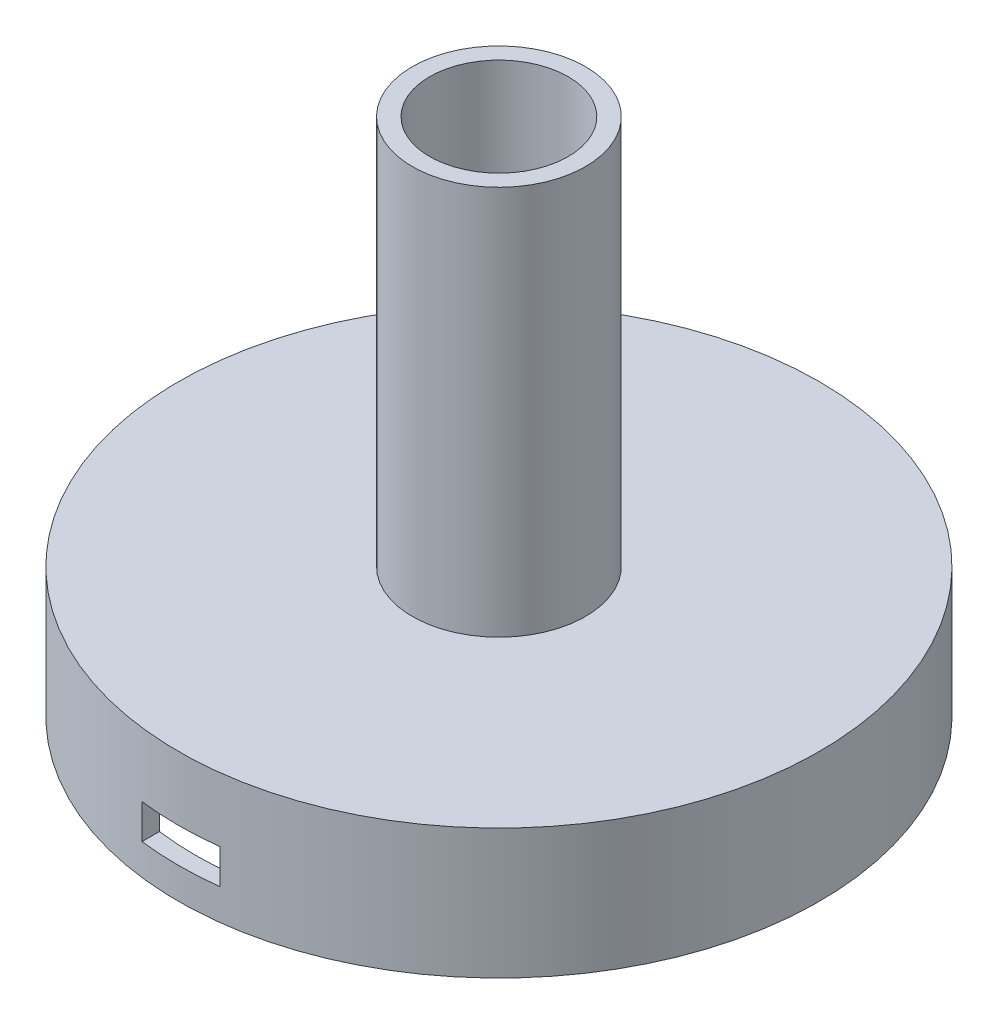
ISO-10303-21;
HEADER;
FILE_DESCRIPTION(('STEP AP214'),'2;1');
FILE_NAME('part.step','',(''),(''),'','','');
FILE_SCHEMA(('AUTOMOTIVE_DESIGN { 1 0 10303 214 1 1 1 1 }'));
ENDSEC;
DATA;
#1=APPLICATION_CONTEXT('core data for automotive mechanical design processes');
#2=APPLICATION_PROTOCOL_DEFINITION('international standard','automotive_design',2000,#1);
#3=PRODUCT_CONTEXT('',#1,'mechanical');
#4=PRODUCT('Part','Part','',(#3));
#5=PRODUCT_RELATED_PRODUCT_CATEGORY('part','',(#4));
#6=PRODUCT_DEFINITION_FORMATION('','',#4);
#7=PRODUCT_DEFINITION_CONTEXT('part definition',#1,'design');
#8=PRODUCT_DEFINITION('design','',#6,#7);
#9=PRODUCT_DEFINITION_SHAPE('','',#8);
#10=(LENGTH_UNIT() NAMED_UNIT(*) SI_UNIT(.MILLI.,.METRE.));
#11=(NAMED_UNIT(*) PLANE_ANGLE_UNIT() SI_UNIT($,.RADIAN.));
#12=(NAMED_UNIT(*) SI_UNIT($,.STERADIAN.) SOLID_ANGLE_UNIT());
#13=UNCERTAINTY_MEASURE_WITH_UNIT(LENGTH_MEASURE(1.E-05),#10,'distance_accuracy_value','');
#14=(GEOMETRIC_REPRESENTATION_CONTEXT(3) GLOBAL_UNCERTAINTY_ASSIGNED_CONTEXT((#13)) GLOBAL_UNIT_ASSIGNED_CONTEXT((#10,
#11,#12)) REPRESENTATION_CONTEXT('',''));
#15=CARTESIAN_POINT('',(0.,0.,0.));
#16=DIRECTION('',(0.,0.,1.));
#17=DIRECTION('',(1.,0.,0.));
#18=AXIS2_PLACEMENT_3D('',#15,#16,#17);
#19=CARTESIAN_POINT('',(0.,0.,0.));
#20=DIRECTION('',(0.,-1.,0.));
#21=DIRECTION('',(0.,0.,-1.));
#22=AXIS2_PLACEMENT_3D('',#19,#20,#21);
#23=CYLINDRICAL_SURFACE('',#22,35.);
#24=CARTESIAN_POINT('',(0.,0.,0.));
#25=DIRECTION('',(0.,-1.,0.));
#26=DIRECTION('',(0.,0.,-1.));
#27=AXIS2_PLACEMENT_3D('',#24,#25,#26);
#28=CIRCLE('',#27,35.);
#29=CARTESIAN_POINT('',(0.,0.,-35.));
#30=VERTEX_POINT('',#29);
#31=EDGE_CURVE('E241',#30,#30,#28,.T.);
#32=ORIENTED_EDGE('',*,*,#31,.T.);
#33=EDGE_LOOP('',(#32));
#34=FACE_BOUND('',#33,.T.);
#35=DIRECTION('',(0.,-1.,0.));
#36=VECTOR('',#35,1.);
#37=CARTESIAN_POINT('',(4.5,0.,34.7095087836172));
#38=LINE('',#37,#36);
#39=CARTESIAN_POINT('',(4.5,7.6,34.7095087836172));
#40=VERTEX_POINT('',#39);
#41=CARTESIAN_POINT('',(4.5,3.6,34.7095087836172));
#42=VERTEX_POINT('',#41);
#43=EDGE_CURVE('E223',#40,#42,#38,.T.);
#44=ORIENTED_EDGE('',*,*,#43,.F.);
#45=CARTESIAN_POINT('',(0.,7.6,0.));
#46=DIRECTION('',(0.,-1.,0.));
#47=DIRECTION('',(0.,0.,-1.));
#48=AXIS2_PLACEMENT_3D('',#45,#46,#47);
#49=CIRCLE('',#48,35.);
#50=CARTESIAN_POINT('',(-4.5,7.6,34.7095087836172));
#51=VERTEX_POINT('',#50);
#52=EDGE_CURVE('E221',#51,#40,#49,.F.);
#53=ORIENTED_EDGE('',*,*,#52,.F.);
#54=DIRECTION('',(0.,-1.,0.));
#55=VECTOR('',#54,1.);
#56=CARTESIAN_POINT('',(-4.5,0.,34.7095087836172));
#57=LINE('',#56,#55);
#58=CARTESIAN_POINT('',(-4.5,3.6,34.7095087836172));
#59=VERTEX_POINT('',#58);
#60=EDGE_CURVE('E219',#59,#51,#57,.F.);
#61=ORIENTED_EDGE('',*,*,#60,.F.);
#62=CARTESIAN_POINT('',(0.,3.6,0.));
#63=DIRECTION('',(0.,1.,0.));
#64=DIRECTION('',(-1.,0.,0.));
#65=AXIS2_PLACEMENT_3D('',#62,#63,#64);
#66=CIRCLE('',#65,35.);
#67=EDGE_CURVE('E217',#42,#59,#66,.F.);
#68=ORIENTED_EDGE('',*,*,#67,.F.);
#69=EDGE_LOOP('',(#44,#53,#61,#68));
#70=FACE_BOUND('',#69,.T.);
#71=DIRECTION('',(0.,-1.,0.));
#72=VECTOR('',#71,1.);
#73=CARTESIAN_POINT('',(-34.8611076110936,0.,3.11499215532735));
#74=LINE('',#73,#72);
#75=CARTESIAN_POINT('',(-34.8611076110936,13.,3.11499215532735));
#76=VERTEX_POINT('',#75);
#77=CARTESIAN_POINT('',(-34.8611076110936,1.99999999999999,3.11499215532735));
#78=VERTEX_POINT('',#77);
#79=EDGE_CURVE('E142',#76,#78,#74,.T.);
#80=ORIENTED_EDGE('',*,*,#79,.F.);
#81=CARTESIAN_POINT('',(0.,13.,0.));
#82=DIRECTION('',(0.,-1.,0.));
#83=DIRECTION('',(0.,0.,-1.));
#84=AXIS2_PLACEMENT_3D('',#81,#82,#83);
#85=CIRCLE('',#84,35.);
#86=CARTESIAN_POINT('',(34.8611076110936,13.,3.11499215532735));
#87=VERTEX_POINT('',#86);
#88=EDGE_CURVE('E245',#87,#76,#85,.T.);
#89=ORIENTED_EDGE('',*,*,#88,.F.);
#90=DIRECTION('',(0.,-1.,0.));
#91=VECTOR('',#90,1.);
#92=CARTESIAN_POINT('',(34.8611076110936,0.,3.11499215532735));
#93=LINE('',#92,#91);
#94=CARTESIAN_POINT('',(34.8611076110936,1.99999999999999,3.11499215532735));
#95=VERTEX_POINT('',#94);
#96=EDGE_CURVE('E203',#95,#87,#93,.F.);
#97=ORIENTED_EDGE('',*,*,#96,.F.);
#98=CARTESIAN_POINT('',(0.,1.99999999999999,0.));
#99=DIRECTION('',(0.,-1.,0.));
#100=DIRECTION('',(0.,0.,-1.));
#101=AXIS2_PLACEMENT_3D('',#98,#99,#100);
#102=CIRCLE('',#101,35.);
#103=CARTESIAN_POINT('',(34.9012937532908,1.99999999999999,2.62672692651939));
#104=VERTEX_POINT('',#103);
#105=EDGE_CURVE('E266',#95,#104,#102,.F.);
#106=ORIENTED_EDGE('',*,*,#105,.T.);
#107=DIRECTION('',(0.,-1.,0.));
#108=VECTOR('',#107,1.);
#109=CARTESIAN_POINT('',(34.9012937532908,0.,2.62672692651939));
#110=LINE('',#109,#108);
#111=CARTESIAN_POINT('',(34.9012937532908,13.,2.62672692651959));
#112=VERTEX_POINT('',#111);
#113=EDGE_CURVE('E200',#112,#104,#110,.T.);
#114=ORIENTED_EDGE('',*,*,#113,.F.);
#115=CARTESIAN_POINT('',(-34.9012937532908,13.,2.62672692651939));
#116=VERTEX_POINT('',#115);
#117=EDGE_CURVE('E244',#116,#112,#85,.T.);
#118=ORIENTED_EDGE('',*,*,#117,.F.);
#119=DIRECTION('',(0.,-1.,0.));
#120=VECTOR('',#119,1.);
#121=CARTESIAN_POINT('',(-34.9012937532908,0.,2.62672692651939));
#122=LINE('',#121,#120);
#123=CARTESIAN_POINT('',(-34.9012937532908,1.99999999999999,2.62672692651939));
#124=VERTEX_POINT('',#123);
#125=EDGE_CURVE('E55',#124,#116,#122,.F.);
#126=ORIENTED_EDGE('',*,*,#125,.F.);
#127=CARTESIAN_POINT('',(0.,1.99999999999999,0.));
#128=DIRECTION('',(0.,-1.,0.));
#129=DIRECTION('',(0.,0.,-1.));
#130=AXIS2_PLACEMENT_3D('',#127,#128,#129);
#131=CIRCLE('',#130,35.);
#132=EDGE_CURVE('E11',#124,#78,#131,.F.);
#133=ORIENTED_EDGE('',*,*,#132,.T.);
#134=EDGE_LOOP('',(#80,#89,#97,#106,#114,#118,#126,#133));
#135=FACE_BOUND('',#134,.T.);
#136=ADVANCED_FACE('F37',(#34,#70,#135),#23,.F.);
#137=CARTESIAN_POINT('',(0.,0.,0.));
#138=DIRECTION('',(0.,-1.,0.));
#139=DIRECTION('',(0.,0.,-1.));
#140=AXIS2_PLACEMENT_3D('',#137,#138,#139);
#141=CYLINDRICAL_SURFACE('',#140,37.);
#142=CARTESIAN_POINT('',(0.,15.,0.));
#143=DIRECTION('',(0.,-1.,0.));
#144=DIRECTION('',(0.,0.,-1.));
#145=AXIS2_PLACEMENT_3D('',#142,#143,#144);
#146=CIRCLE('',#145,37.);
#147=CARTESIAN_POINT('',(0.,15.,-37.));
#148=VERTEX_POINT('',#147);
#149=EDGE_CURVE('E235',#148,#148,#146,.T.);
#150=ORIENTED_EDGE('',*,*,#149,.T.);
#151=EDGE_LOOP('',(#150));
#152=FACE_BOUND('',#151,.T.);
#153=CARTESIAN_POINT('',(0.,0.,0.));
#154=DIRECTION('',(0.,-1.,0.));
#155=DIRECTION('',(0.,0.,-1.));
#156=AXIS2_PLACEMENT_3D('',#153,#154,#155);
#157=CIRCLE('',#156,37.);
#158=CARTESIAN_POINT('',(0.,0.,-37.));
#159=VERTEX_POINT('',#158);
#160=EDGE_CURVE('E238',#159,#159,#157,.T.);
#161=ORIENTED_EDGE('',*,*,#160,.F.);
#162=EDGE_LOOP('',(#161));
#163=FACE_BOUND('',#162,.T.);
#164=CARTESIAN_POINT('',(0.,7.6,0.));
#165=DIRECTION('',(0.,-1.,0.));
#166=DIRECTION('',(0.,0.,-1.));
#167=AXIS2_PLACEMENT_3D('',#164,#165,#166);
#168=CIRCLE('',#167,37.);
#169=CARTESIAN_POINT('',(-4.5,7.6,36.7253318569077));
#170=VERTEX_POINT('',#169);
#171=CARTESIAN_POINT('',(4.5,7.6,36.7253318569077));
#172=VERTEX_POINT('',#171);
#173=EDGE_CURVE('E257',#170,#172,#168,.F.);
#174=ORIENTED_EDGE('',*,*,#173,.T.);
#175=DIRECTION('',(0.,-1.,0.));
#176=VECTOR('',#175,1.);
#177=CARTESIAN_POINT('',(4.5,0.,36.7253318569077));
#178=LINE('',#177,#176);
#179=CARTESIAN_POINT('',(4.5,3.6,36.7253318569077));
#180=VERTEX_POINT('',#179);
#181=EDGE_CURVE('E260',#172,#180,#178,.T.);
#182=ORIENTED_EDGE('',*,*,#181,.T.);
#183=CARTESIAN_POINT('',(0.,3.6,0.));
#184=DIRECTION('',(0.,1.,0.));
#185=DIRECTION('',(-1.,0.,0.));
#186=AXIS2_PLACEMENT_3D('',#183,#184,#185);
#187=CIRCLE('',#186,37.);
#188=CARTESIAN_POINT('',(-4.5,3.6,36.7253318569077));
#189=VERTEX_POINT('',#188);
#190=EDGE_CURVE('E251',#180,#189,#187,.F.);
#191=ORIENTED_EDGE('',*,*,#190,.T.);
#192=DIRECTION('',(0.,-1.,0.));
#193=VECTOR('',#192,1.);
#194=CARTESIAN_POINT('',(-4.5,0.,36.7253318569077));
#195=LINE('',#194,#193);
#196=EDGE_CURVE('E254',#189,#170,#195,.F.);
#197=ORIENTED_EDGE('',*,*,#196,.T.);
#198=EDGE_LOOP('',(#174,#182,#191,#197));
#199=FACE_BOUND('',#198,.T.);
#200=ADVANCED_FACE('F316',(#152,#163,#199),#141,.T.);
#201=CARTESIAN_POINT('',(0.,0.,0.));
#202=DIRECTION('',(0.,-1.,0.));
#203=DIRECTION('',(0.,0.,-1.));
#204=AXIS2_PLACEMENT_3D('',#201,#202,#203);
#205=CYLINDRICAL_SURFACE('',#204,8.);
#206=CARTESIAN_POINT('',(0.,60.,0.));
#207=DIRECTION('',(0.,-1.,0.));
#208=DIRECTION('',(0.,0.,-1.));
#209=AXIS2_PLACEMENT_3D('',#206,#207,#208);
#210=CIRCLE('',#209,8.);
#211=CARTESIAN_POINT('',(0.,60.,-8.));
#212=VERTEX_POINT('',#211);
#213=EDGE_CURVE('E226',#212,#212,#210,.T.);
#214=ORIENTED_EDGE('',*,*,#213,.F.);
#215=EDGE_LOOP('',(#214));
#216=FACE_BOUND('',#215,.T.);
#217=CARTESIAN_POINT('',(0.,13.,0.));
#218=DIRECTION('',(0.,-1.,0.));
#219=DIRECTION('',(0.,0.,-1.));
#220=AXIS2_PLACEMENT_3D('',#217,#218,#219);
#221=CIRCLE('',#220,8.);
#222=CARTESIAN_POINT('',(0.,13.,-8.));
#223=VERTEX_POINT('',#222);
#224=EDGE_CURVE('E248',#223,#223,#221,.T.);
#225=ORIENTED_EDGE('',*,*,#224,.T.);
#226=EDGE_LOOP('',(#225));
#227=FACE_BOUND('',#226,.T.);
#228=ADVANCED_FACE('F39',(#216,#227),#205,.F.);
#229=CARTESIAN_POINT('',(-37.,13.,0.));
#230=DIRECTION('',(0.,1.,0.));
#231=DIRECTION('',(0.,0.,1.));
#232=AXIS2_PLACEMENT_3D('',#229,#230,#231);
#233=PLANE('',#232);
#234=DIRECTION('',(-1.,0.,0.));
#235=VECTOR('',#234,1.);
#236=CARTESIAN_POINT('',(-34.9012937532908,13.,3.11499215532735));
#237=LINE('',#236,#235);
#238=CARTESIAN_POINT('',(-27.9012937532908,13.,3.11499215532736));
#239=VERTEX_POINT('',#238);
#240=EDGE_CURVE('E280',#239,#76,#237,.T.);
#241=ORIENTED_EDGE('',*,*,#240,.F.);
#242=DIRECTION('',(0.,0.,1.));
#243=VECTOR('',#242,1.);
#244=CARTESIAN_POINT('',(-27.9012937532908,13.,3.11499215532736));
#245=LINE('',#244,#243);
#246=CARTESIAN_POINT('',(-27.9012937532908,13.,-1.88500784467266));
#247=VERTEX_POINT('',#246);
#248=EDGE_CURVE('E157',#247,#239,#245,.T.);
#249=ORIENTED_EDGE('',*,*,#248,.F.);
#250=DIRECTION('',(1.,0.,0.));
#251=VECTOR('',#250,1.);
#252=CARTESIAN_POINT('',(-34.9012937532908,13.,-1.88500784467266));
#253=LINE('',#252,#251);
#254=CARTESIAN_POINT('',(-34.9012937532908,13.,-1.88500784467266));
#255=VERTEX_POINT('',#254);
#256=EDGE_CURVE('E154',#255,#247,#253,.T.);
#257=ORIENTED_EDGE('',*,*,#256,.F.);
#258=DIRECTION('',(0.,0.,-1.));
#259=VECTOR('',#258,1.);
#260=CARTESIAN_POINT('',(-34.9012937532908,13.,0.));
#261=LINE('',#260,#259);
#262=EDGE_CURVE('E45',#116,#255,#261,.T.);
#263=ORIENTED_EDGE('',*,*,#262,.F.);
#264=ORIENTED_EDGE('',*,*,#117,.T.);
#265=DIRECTION('',(0.,0.,1.));
#266=VECTOR('',#265,1.);
#267=CARTESIAN_POINT('',(34.9012937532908,13.,3.11499215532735));
#268=LINE('',#267,#266);
#269=CARTESIAN_POINT('',(34.9012937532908,13.,-1.88500784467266));
#270=VERTEX_POINT('',#269);
#271=EDGE_CURVE('E177',#270,#112,#268,.T.);
#272=ORIENTED_EDGE('',*,*,#271,.F.);
#273=DIRECTION('',(1.,0.,0.));
#274=VECTOR('',#273,1.);
#275=CARTESIAN_POINT('',(34.9012937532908,13.,-1.88500784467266));
#276=LINE('',#275,#274);
#277=CARTESIAN_POINT('',(27.9012937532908,13.,-1.88500784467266));
#278=VERTEX_POINT('',#277);
#279=EDGE_CURVE('E187',#278,#270,#276,.T.);
#280=ORIENTED_EDGE('',*,*,#279,.F.);
#281=DIRECTION('',(0.,0.,-1.));
#282=VECTOR('',#281,1.);
#283=CARTESIAN_POINT('',(27.9012937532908,13.,3.11499215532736));
#284=LINE('',#283,#282);
#285=CARTESIAN_POINT('',(27.9012937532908,13.,3.11499215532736));
#286=VERTEX_POINT('',#285);
#287=EDGE_CURVE('E171',#286,#278,#284,.T.);
#288=ORIENTED_EDGE('',*,*,#287,.F.);
#289=DIRECTION('',(-1.,0.,0.));
#290=VECTOR('',#289,1.);
#291=CARTESIAN_POINT('',(-37.,13.,3.11499215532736));
#292=LINE('',#291,#290);
#293=EDGE_CURVE('E263',#87,#286,#292,.T.);
#294=ORIENTED_EDGE('',*,*,#293,.F.);
#295=ORIENTED_EDGE('',*,*,#88,.T.);
#296=EDGE_LOOP('',(#241,#249,#257,#263,#264,#272,#280,#288,#294,#295));
#297=FACE_BOUND('',#296,.T.);
#298=ORIENTED_EDGE('',*,*,#224,.F.);
#299=EDGE_LOOP('',(#298));
#300=FACE_BOUND('',#299,.T.);
#301=ADVANCED_FACE('F283',(#297,#300),#233,.F.);
#302=CARTESIAN_POINT('',(-35.,0.,0.));
#303=DIRECTION('',(0.,-1.,0.));
#304=DIRECTION('',(0.,0.,-1.));
#305=AXIS2_PLACEMENT_3D('',#302,#303,#304);
#306=PLANE('',#305);
#307=ORIENTED_EDGE('',*,*,#160,.T.);
#308=EDGE_LOOP('',(#307));
#309=FACE_BOUND('',#308,.T.);
#310=ORIENTED_EDGE('',*,*,#31,.F.);
#311=EDGE_LOOP('',(#310));
#312=FACE_BOUND('',#311,.T.);
#313=ADVANCED_FACE('F326',(#309,#312),#306,.T.);
#314=CARTESIAN_POINT('',(-37.,15.,0.));
#315=DIRECTION('',(0.,1.,0.));
#316=DIRECTION('',(0.,0.,1.));
#317=AXIS2_PLACEMENT_3D('',#314,#315,#316);
#318=PLANE('',#317);
#319=CARTESIAN_POINT('',(0.,15.,0.));
#320=DIRECTION('',(0.,-1.,0.));
#321=DIRECTION('',(0.,0.,-1.));
#322=AXIS2_PLACEMENT_3D('',#319,#320,#321);
#323=CIRCLE('',#322,10.);
#324=CARTESIAN_POINT('',(0.,15.,-10.));
#325=VERTEX_POINT('',#324);
#326=EDGE_CURVE('E232',#325,#325,#323,.T.);
#327=ORIENTED_EDGE('',*,*,#326,.T.);
#328=EDGE_LOOP('',(#327));
#329=FACE_BOUND('',#328,.T.);
#330=ORIENTED_EDGE('',*,*,#149,.F.);
#331=EDGE_LOOP('',(#330));
#332=FACE_BOUND('',#331,.T.);
#333=ADVANCED_FACE('F334',(#329,#332),#318,.T.);
#334=CARTESIAN_POINT('',(0.,0.,0.));
#335=DIRECTION('',(0.,-1.,0.));
#336=DIRECTION('',(0.,0.,-1.));
#337=AXIS2_PLACEMENT_3D('',#334,#335,#336);
#338=CYLINDRICAL_SURFACE('',#337,10.);
#339=CARTESIAN_POINT('',(0.,60.,0.));
#340=DIRECTION('',(0.,-1.,0.));
#341=DIRECTION('',(0.,0.,-1.));
#342=AXIS2_PLACEMENT_3D('',#339,#340,#341);
#343=CIRCLE('',#342,10.);
#344=CARTESIAN_POINT('',(0.,60.,-10.));
#345=VERTEX_POINT('',#344);
#346=EDGE_CURVE('E229',#345,#345,#343,.T.);
#347=ORIENTED_EDGE('',*,*,#346,.T.);
#348=EDGE_LOOP('',(#347));
#349=FACE_BOUND('',#348,.T.);
#350=ORIENTED_EDGE('',*,*,#326,.F.);
#351=EDGE_LOOP('',(#350));
#352=FACE_BOUND('',#351,.T.);
#353=ADVANCED_FACE('F385',(#349,#352),#338,.T.);
#354=CARTESIAN_POINT('',(-10.,60.,0.));
#355=DIRECTION('',(0.,1.,0.));
#356=DIRECTION('',(0.,0.,1.));
#357=AXIS2_PLACEMENT_3D('',#354,#355,#356);
#358=PLANE('',#357);
#359=ORIENTED_EDGE('',*,*,#213,.T.);
#360=EDGE_LOOP('',(#359));
#361=FACE_BOUND('',#360,.T.);
#362=ORIENTED_EDGE('',*,*,#346,.F.);
#363=EDGE_LOOP('',(#362));
#364=FACE_BOUND('',#363,.T.);
#365=ADVANCED_FACE('F381',(#361,#364),#358,.T.);
#366=CARTESIAN_POINT('',(4.5,7.6,58.));
#367=DIRECTION('',(-1.,0.,0.));
#368=DIRECTION('',(0.,0.,1.));
#369=AXIS2_PLACEMENT_3D('',#366,#367,#368);
#370=PLANE('',#369);
#371=ORIENTED_EDGE('',*,*,#43,.T.);
#372=DIRECTION('',(0.,0.,-1.));
#373=VECTOR('',#372,1.);
#374=CARTESIAN_POINT('',(4.5,3.6,58.));
#375=LINE('',#374,#373);
#376=EDGE_CURVE('E206',#180,#42,#375,.T.);
#377=ORIENTED_EDGE('',*,*,#376,.F.);
#378=ORIENTED_EDGE('',*,*,#181,.F.);
#379=DIRECTION('',(0.,0.,-1.));
#380=VECTOR('',#379,1.);
#381=CARTESIAN_POINT('',(4.5,7.6,58.));
#382=LINE('',#381,#380);
#383=EDGE_CURVE('E214',#172,#40,#382,.T.);
#384=ORIENTED_EDGE('',*,*,#383,.T.);
#385=EDGE_LOOP('',(#371,#377,#378,#384));
#386=FACE_BOUND('',#385,.T.);
#387=ADVANCED_FACE('F377',(#386),#370,.T.);
#388=CARTESIAN_POINT('',(-4.5,7.6,58.));
#389=DIRECTION('',(0.,-1.,0.));
#390=DIRECTION('',(0.,0.,-1.));
#391=AXIS2_PLACEMENT_3D('',#388,#389,#390);
#392=PLANE('',#391);
#393=ORIENTED_EDGE('',*,*,#52,.T.);
#394=ORIENTED_EDGE('',*,*,#383,.F.);
#395=ORIENTED_EDGE('',*,*,#173,.F.);
#396=DIRECTION('',(0.,0.,-1.));
#397=VECTOR('',#396,1.);
#398=CARTESIAN_POINT('',(-4.5,7.6,58.));
#399=LINE('',#398,#397);
#400=EDGE_CURVE('E211',#170,#51,#399,.T.);
#401=ORIENTED_EDGE('',*,*,#400,.T.);
#402=EDGE_LOOP('',(#393,#394,#395,#401));
#403=FACE_BOUND('',#402,.T.);
#404=ADVANCED_FACE('F371',(#403),#392,.T.);
#405=CARTESIAN_POINT('',(-4.5,7.6,58.));
#406=DIRECTION('',(1.,0.,0.));
#407=DIRECTION('',(0.,0.,-1.));
#408=AXIS2_PLACEMENT_3D('',#405,#406,#407);
#409=PLANE('',#408);
#410=ORIENTED_EDGE('',*,*,#60,.T.);
#411=ORIENTED_EDGE('',*,*,#400,.F.);
#412=ORIENTED_EDGE('',*,*,#196,.F.);
#413=DIRECTION('',(0.,0.,-1.));
#414=VECTOR('',#413,1.);
#415=CARTESIAN_POINT('',(-4.5,3.6,58.));
#416=LINE('',#415,#414);
#417=EDGE_CURVE('E208',#189,#59,#416,.T.);
#418=ORIENTED_EDGE('',*,*,#417,.T.);
#419=EDGE_LOOP('',(#410,#411,#412,#418));
#420=FACE_BOUND('',#419,.T.);
#421=ADVANCED_FACE('F364',(#420),#409,.T.);
#422=CARTESIAN_POINT('',(-4.5,3.6,58.));
#423=DIRECTION('',(0.,1.,0.));
#424=DIRECTION('',(-1.,0.,0.));
#425=AXIS2_PLACEMENT_3D('',#422,#423,#424);
#426=PLANE('',#425);
#427=ORIENTED_EDGE('',*,*,#67,.T.);
#428=ORIENTED_EDGE('',*,*,#417,.F.);
#429=ORIENTED_EDGE('',*,*,#190,.F.);
#430=ORIENTED_EDGE('',*,*,#376,.T.);
#431=EDGE_LOOP('',(#427,#428,#429,#430));
#432=FACE_BOUND('',#431,.T.);
#433=ADVANCED_FACE('F359',(#432),#426,.T.);
#434=CARTESIAN_POINT('',(0.,1.99999999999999,0.));
#435=DIRECTION('',(0.,-1.,0.));
#436=DIRECTION('',(0.,0.,-1.));
#437=AXIS2_PLACEMENT_3D('',#434,#435,#436);
#438=PLANE('',#437);
#439=CARTESIAN_POINT('',(31.4012937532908,1.99999999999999,0.614992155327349));
#440=DIRECTION('',(0.,-1.,0.));
#441=DIRECTION('',(0.,0.,1.));
#442=AXIS2_PLACEMENT_3D('',#439,#440,#441);
#443=CIRCLE('',#442,1.25);
#444=CARTESIAN_POINT('',(31.4012937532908,1.99999999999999,1.86499215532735));
#445=VERTEX_POINT('',#444);
#446=EDGE_CURVE('E168',#445,#445,#443,.T.);
#447=ORIENTED_EDGE('',*,*,#446,.F.);
#448=EDGE_LOOP('',(#447));
#449=FACE_BOUND('',#448,.T.);
#450=ORIENTED_EDGE('',*,*,#105,.F.);
#451=DIRECTION('',(-1.,0.,0.));
#452=VECTOR('',#451,1.);
#453=CARTESIAN_POINT('',(34.9012937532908,1.99999999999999,3.11499215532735));
#454=LINE('',#453,#452);
#455=CARTESIAN_POINT('',(27.9012937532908,1.99999999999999,3.11499215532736));
#456=VERTEX_POINT('',#455);
#457=EDGE_CURVE('E174',#95,#456,#454,.T.);
#458=ORIENTED_EDGE('',*,*,#457,.T.);
#459=DIRECTION('',(0.,0.,-1.));
#460=VECTOR('',#459,1.);
#461=CARTESIAN_POINT('',(27.9012937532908,1.99999999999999,3.11499215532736));
#462=LINE('',#461,#460);
#463=CARTESIAN_POINT('',(27.9012937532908,1.99999999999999,-1.88500784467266));
#464=VERTEX_POINT('',#463);
#465=EDGE_CURVE('E176',#456,#464,#462,.T.);
#466=ORIENTED_EDGE('',*,*,#465,.T.);
#467=DIRECTION('',(1.,0.,0.));
#468=VECTOR('',#467,1.);
#469=CARTESIAN_POINT('',(34.9012937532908,1.99999999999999,-1.88500784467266));
#470=LINE('',#469,#468);
#471=CARTESIAN_POINT('',(34.9012937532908,1.99999999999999,-1.88500784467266));
#472=VERTEX_POINT('',#471);
#473=EDGE_CURVE('E179',#464,#472,#470,.T.);
#474=ORIENTED_EDGE('',*,*,#473,.T.);
#475=DIRECTION('',(0.,0.,1.));
#476=VECTOR('',#475,1.);
#477=CARTESIAN_POINT('',(34.9012937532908,1.99999999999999,3.11499215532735));
#478=LINE('',#477,#476);
#479=EDGE_CURVE('E181',#472,#104,#478,.T.);
#480=ORIENTED_EDGE('',*,*,#479,.T.);
#481=EDGE_LOOP('',(#450,#458,#466,#474,#480));
#482=FACE_BOUND('',#481,.T.);
#483=ADVANCED_FACE('F293',(#449,#482),#438,.T.);
#484=CARTESIAN_POINT('',(34.9012937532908,1.99999999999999,3.11499215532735));
#485=DIRECTION('',(0.,0.,-1.));
#486=DIRECTION('',(-1.,0.,0.));
#487=AXIS2_PLACEMENT_3D('',#484,#485,#486);
#488=PLANE('',#487);
#489=ORIENTED_EDGE('',*,*,#457,.F.);
#490=ORIENTED_EDGE('',*,*,#96,.T.);
#491=ORIENTED_EDGE('',*,*,#293,.T.);
#492=DIRECTION('',(0.,1.,0.));
#493=VECTOR('',#492,1.);
#494=CARTESIAN_POINT('',(27.9012937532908,1.99999999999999,3.11499215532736));
#495=LINE('',#494,#493);
#496=EDGE_CURVE('E197',#456,#286,#495,.T.);
#497=ORIENTED_EDGE('',*,*,#496,.F.);
#498=EDGE_LOOP('',(#489,#490,#491,#497));
#499=FACE_BOUND('',#498,.T.);
#500=ADVANCED_FACE('F289',(#499),#488,.F.);
#501=CARTESIAN_POINT('',(34.9012937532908,1.99999999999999,3.11499215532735));
#502=DIRECTION('',(-1.,0.,0.));
#503=DIRECTION('',(0.,0.,1.));
#504=AXIS2_PLACEMENT_3D('',#501,#502,#503);
#505=PLANE('',#504);
#506=ORIENTED_EDGE('',*,*,#271,.T.);
#507=ORIENTED_EDGE('',*,*,#113,.T.);
#508=ORIENTED_EDGE('',*,*,#479,.F.);
#509=DIRECTION('',(0.,1.,0.));
#510=VECTOR('',#509,1.);
#511=CARTESIAN_POINT('',(34.9012937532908,1.99999999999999,-1.88500784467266));
#512=LINE('',#511,#510);
#513=EDGE_CURVE('E184',#472,#270,#512,.T.);
#514=ORIENTED_EDGE('',*,*,#513,.T.);
#515=EDGE_LOOP('',(#506,#507,#508,#514));
#516=FACE_BOUND('',#515,.T.);
#517=ADVANCED_FACE('F303',(#516),#505,.F.);
#518=CARTESIAN_POINT('',(27.9012937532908,1.99999999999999,3.11499215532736));
#519=DIRECTION('',(1.,0.,0.));
#520=DIRECTION('',(0.,0.,-1.));
#521=AXIS2_PLACEMENT_3D('',#518,#519,#520);
#522=PLANE('',#521);
#523=ORIENTED_EDGE('',*,*,#287,.T.);
#524=DIRECTION('',(0.,1.,0.));
#525=VECTOR('',#524,1.);
#526=CARTESIAN_POINT('',(27.9012937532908,1.99999999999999,-1.88500784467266));
#527=LINE('',#526,#525);
#528=EDGE_CURVE('E194',#464,#278,#527,.T.);
#529=ORIENTED_EDGE('',*,*,#528,.F.);
#530=ORIENTED_EDGE('',*,*,#465,.F.);
#531=ORIENTED_EDGE('',*,*,#496,.T.);
#532=EDGE_LOOP('',(#523,#529,#530,#531));
#533=FACE_BOUND('',#532,.T.);
#534=ADVANCED_FACE('F296',(#533),#522,.F.);
#535=CARTESIAN_POINT('',(34.9012937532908,1.99999999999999,-1.88500784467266));
#536=DIRECTION('',(0.,0.,1.));
#537=DIRECTION('',(1.,0.,0.));
#538=AXIS2_PLACEMENT_3D('',#535,#536,#537);
#539=PLANE('',#538);
#540=ORIENTED_EDGE('',*,*,#279,.T.);
#541=ORIENTED_EDGE('',*,*,#513,.F.);
#542=ORIENTED_EDGE('',*,*,#473,.F.);
#543=ORIENTED_EDGE('',*,*,#528,.T.);
#544=EDGE_LOOP('',(#540,#541,#542,#543));
#545=FACE_BOUND('',#544,.T.);
#546=ADVANCED_FACE('F300',(#545),#539,.F.);
#547=CARTESIAN_POINT('',(31.4012937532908,1.99999999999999,0.614992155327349));
#548=DIRECTION('',(0.,1.,0.));
#549=DIRECTION('',(0.,0.,1.));
#550=AXIS2_PLACEMENT_3D('',#547,#548,#549);
#551=CYLINDRICAL_SURFACE('',#550,1.25);
#552=ORIENTED_EDGE('',*,*,#446,.T.);
#553=EDGE_LOOP('',(#552));
#554=FACE_BOUND('',#553,.T.);
#555=CARTESIAN_POINT('',(31.4012937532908,13.,0.614992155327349));
#556=DIRECTION('',(0.,-1.,0.));
#557=DIRECTION('',(0.,0.,1.));
#558=AXIS2_PLACEMENT_3D('',#555,#556,#557);
#559=CIRCLE('',#558,1.25);
#560=CARTESIAN_POINT('',(31.4012937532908,13.,1.86499215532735));
#561=VERTEX_POINT('',#560);
#562=EDGE_CURVE('E167',#561,#561,#559,.T.);
#563=ORIENTED_EDGE('',*,*,#562,.F.);
#564=EDGE_LOOP('',(#563));
#565=FACE_BOUND('',#564,.T.);
#566=ADVANCED_FACE('F341',(#554,#565),#551,.F.);
#567=ORIENTED_EDGE('',*,*,#562,.T.);
#568=EDGE_LOOP('',(#567));
#569=FACE_BOUND('',#568,.T.);
#570=ADVANCED_FACE('F329',(#569),#233,.F.);
#571=CARTESIAN_POINT('',(0.,1.99999999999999,0.));
#572=DIRECTION('',(0.,-1.,0.));
#573=DIRECTION('',(0.,0.,-1.));
#574=AXIS2_PLACEMENT_3D('',#571,#572,#573);
#575=PLANE('',#574);
#576=CARTESIAN_POINT('',(-31.4012937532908,1.99999999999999,0.614992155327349));
#577=DIRECTION('',(0.,-1.,0.));
#578=DIRECTION('',(0.,0.,-1.));
#579=AXIS2_PLACEMENT_3D('',#576,#577,#578);
#580=CIRCLE('',#579,1.25);
#581=CARTESIAN_POINT('',(-31.4012937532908,1.99999999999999,-0.635007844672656));
#582=VERTEX_POINT('',#581);
#583=EDGE_CURVE('E281',#582,#582,#580,.T.);
#584=ORIENTED_EDGE('',*,*,#583,.F.);
#585=EDGE_LOOP('',(#584));
#586=FACE_BOUND('',#585,.T.);
#587=ORIENTED_EDGE('',*,*,#132,.F.);
#588=DIRECTION('',(0.,0.,-1.));
#589=VECTOR('',#588,1.);
#590=CARTESIAN_POINT('',(-34.9012937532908,1.99999999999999,3.11499215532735));
#591=LINE('',#590,#589);
#592=CARTESIAN_POINT('',(-34.9012937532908,1.99999999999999,-1.88500784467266));
#593=VERTEX_POINT('',#592);
#594=EDGE_CURVE('E144',#124,#593,#591,.T.);
#595=ORIENTED_EDGE('',*,*,#594,.T.);
#596=DIRECTION('',(1.,0.,0.));
#597=VECTOR('',#596,1.);
#598=CARTESIAN_POINT('',(-34.9012937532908,1.99999999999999,-1.88500784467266));
#599=LINE('',#598,#597);
#600=CARTESIAN_POINT('',(-27.9012937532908,1.99999999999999,-1.88500784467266));
#601=VERTEX_POINT('',#600);
#602=EDGE_CURVE('E150',#593,#601,#599,.T.);
#603=ORIENTED_EDGE('',*,*,#602,.T.);
#604=DIRECTION('',(0.,0.,1.));
#605=VECTOR('',#604,1.);
#606=CARTESIAN_POINT('',(-27.9012937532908,1.99999999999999,3.11499215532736));
#607=LINE('',#606,#605);
#608=CARTESIAN_POINT('',(-27.9012937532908,1.99999999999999,3.11499215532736));
#609=VERTEX_POINT('',#608);
#610=EDGE_CURVE('E145',#601,#609,#607,.T.);
#611=ORIENTED_EDGE('',*,*,#610,.T.);
#612=DIRECTION('',(-1.,0.,0.));
#613=VECTOR('',#612,1.);
#614=CARTESIAN_POINT('',(-34.9012937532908,1.99999999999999,3.11499215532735));
#615=LINE('',#614,#613);
#616=EDGE_CURVE('E135',#609,#78,#615,.T.);
#617=ORIENTED_EDGE('',*,*,#616,.T.);
#618=EDGE_LOOP('',(#587,#595,#603,#611,#617));
#619=FACE_BOUND('',#618,.T.);
#620=ADVANCED_FACE('F148',(#586,#619),#575,.T.);
#621=CARTESIAN_POINT('',(-34.9012937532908,1.99999999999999,3.11499215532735));
#622=DIRECTION('',(0.,0.,-1.));
#623=DIRECTION('',(-1.,0.,0.));
#624=AXIS2_PLACEMENT_3D('',#621,#622,#623);
#625=PLANE('',#624);
#626=ORIENTED_EDGE('',*,*,#240,.T.);
#627=ORIENTED_EDGE('',*,*,#79,.T.);
#628=ORIENTED_EDGE('',*,*,#616,.F.);
#629=DIRECTION('',(0.,1.,0.));
#630=VECTOR('',#629,1.);
#631=CARTESIAN_POINT('',(-27.9012937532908,1.99999999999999,3.11499215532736));
#632=LINE('',#631,#630);
#633=EDGE_CURVE('E140',#609,#239,#632,.T.);
#634=ORIENTED_EDGE('',*,*,#633,.T.);
#635=EDGE_LOOP('',(#626,#627,#628,#634));
#636=FACE_BOUND('',#635,.T.);
#637=ADVANCED_FACE('F138',(#636),#625,.F.);
#638=CARTESIAN_POINT('',(-34.9012937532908,1.99999999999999,3.11499215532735));
#639=DIRECTION('',(1.,0.,0.));
#640=DIRECTION('',(0.,0.,-1.));
#641=AXIS2_PLACEMENT_3D('',#638,#639,#640);
#642=PLANE('',#641);
#643=ORIENTED_EDGE('',*,*,#594,.F.);
#644=ORIENTED_EDGE('',*,*,#125,.T.);
#645=ORIENTED_EDGE('',*,*,#262,.T.);
#646=DIRECTION('',(0.,1.,0.));
#647=VECTOR('',#646,1.);
#648=CARTESIAN_POINT('',(-34.9012937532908,1.99999999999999,-1.88500784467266));
#649=LINE('',#648,#647);
#650=EDGE_CURVE('E158',#593,#255,#649,.T.);
#651=ORIENTED_EDGE('',*,*,#650,.F.);
#652=EDGE_LOOP('',(#643,#644,#645,#651));
#653=FACE_BOUND('',#652,.T.);
#654=ADVANCED_FACE('F271',(#653),#642,.F.);
#655=CARTESIAN_POINT('',(-27.9012937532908,1.99999999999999,3.11499215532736));
#656=DIRECTION('',(-1.,0.,0.));
#657=DIRECTION('',(0.,0.,1.));
#658=AXIS2_PLACEMENT_3D('',#655,#656,#657);
#659=PLANE('',#658);
#660=ORIENTED_EDGE('',*,*,#248,.T.);
#661=ORIENTED_EDGE('',*,*,#633,.F.);
#662=ORIENTED_EDGE('',*,*,#610,.F.);
#663=DIRECTION('',(0.,1.,0.));
#664=VECTOR('',#663,1.);
#665=CARTESIAN_POINT('',(-27.9012937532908,1.99999999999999,-1.88500784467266));
#666=LINE('',#665,#664);
#667=EDGE_CURVE('E162',#601,#247,#666,.T.);
#668=ORIENTED_EDGE('',*,*,#667,.T.);
#669=EDGE_LOOP('',(#660,#661,#662,#668));
#670=FACE_BOUND('',#669,.T.);
#671=ADVANCED_FACE('F156',(#670),#659,.F.);
#672=CARTESIAN_POINT('',(-34.9012937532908,1.99999999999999,-1.88500784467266));
#673=DIRECTION('',(0.,0.,1.));
#674=DIRECTION('',(1.,0.,0.));
#675=AXIS2_PLACEMENT_3D('',#672,#673,#674);
#676=PLANE('',#675);
#677=ORIENTED_EDGE('',*,*,#256,.T.);
#678=ORIENTED_EDGE('',*,*,#667,.F.);
#679=ORIENTED_EDGE('',*,*,#602,.F.);
#680=ORIENTED_EDGE('',*,*,#650,.T.);
#681=EDGE_LOOP('',(#677,#678,#679,#680));
#682=FACE_BOUND('',#681,.T.);
#683=ADVANCED_FACE('F275',(#682),#676,.F.);
#684=CARTESIAN_POINT('',(-31.4012937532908,1.99999999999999,0.614992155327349));
#685=DIRECTION('',(0.,1.,0.));
#686=DIRECTION('',(0.,0.,1.));
#687=AXIS2_PLACEMENT_3D('',#684,#685,#686);
#688=CYLINDRICAL_SURFACE('',#687,1.25);
#689=ORIENTED_EDGE('',*,*,#583,.T.);
#690=EDGE_LOOP('',(#689));
#691=FACE_BOUND('',#690,.T.);
#692=CARTESIAN_POINT('',(-31.4012937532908,13.,0.614992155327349));
#693=DIRECTION('',(0.,-1.,0.));
#694=DIRECTION('',(0.,0.,-1.));
#695=AXIS2_PLACEMENT_3D('',#692,#693,#694);
#696=CIRCLE('',#695,1.25);
#697=CARTESIAN_POINT('',(-31.4012937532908,13.,-0.635007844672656));
#698=VERTEX_POINT('',#697);
#699=EDGE_CURVE('E542',#698,#698,#696,.T.);
#700=ORIENTED_EDGE('',*,*,#699,.F.);
#701=EDGE_LOOP('',(#700));
#702=FACE_BOUND('',#701,.T.);
#703=ADVANCED_FACE('F338',(#691,#702),#688,.F.);
#704=ORIENTED_EDGE('',*,*,#699,.T.);
#705=EDGE_LOOP('',(#704));
#706=FACE_BOUND('',#705,.T.);
#707=ADVANCED_FACE('F328',(#706),#233,.F.);
#708=CLOSED_SHELL('',(#136,#200,#228,#301,#313,#333,#353,#365,#387,#404,#421,#433,#483,#500,
#517,#534,#546,#566,#570,#620,#637,#654,#671,#683,#703,#707));
#709=MANIFOLD_SOLID_BREP('B2',#708);
#710=ADVANCED_BREP_SHAPE_REPRESENTATION('',(#18,#709),#14);
#711=SHAPE_DEFINITION_REPRESENTATION(#9,#710);
ENDSEC;
END-ISO-10303-21;
